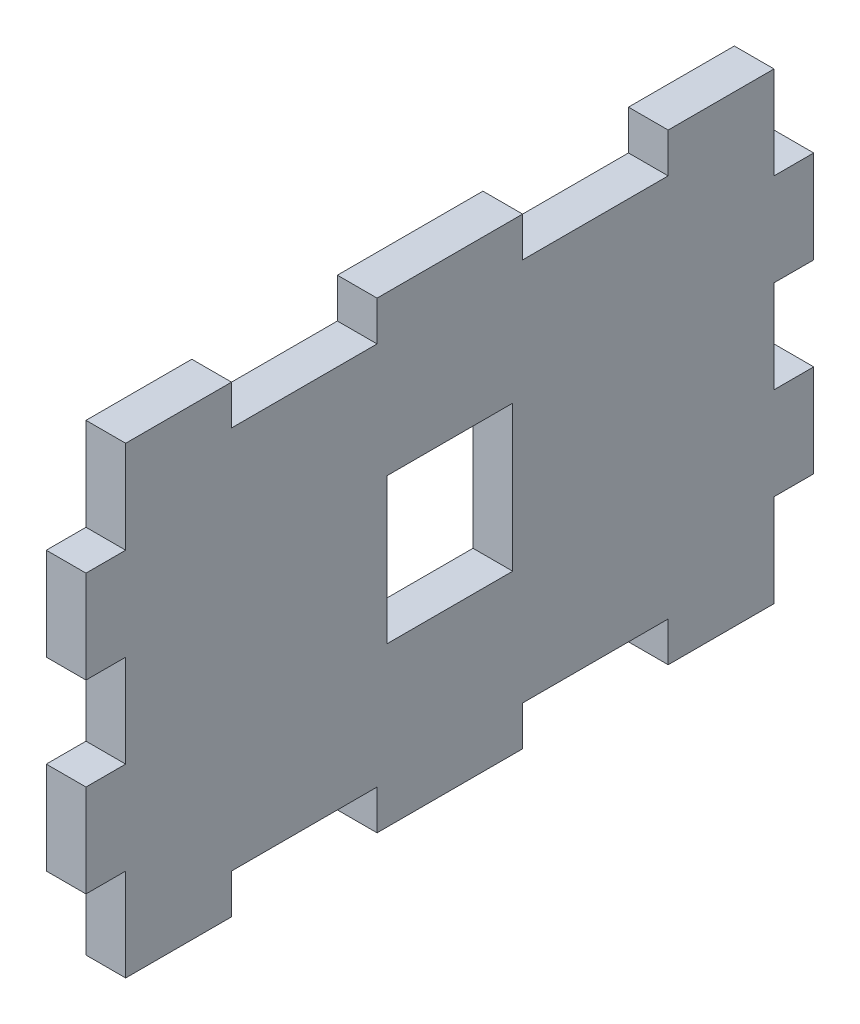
from build123d import *

# Parameters (mm, degrees)
SKETCH1_W           = 55
SKETCH1_H           = 35
BOSS_EXTRUDE1_DEPTH = 3
SKETCH3_W           = 11
SKETCH3_H           = 3
CUT_EXTRUDE1_DEPTH  = 3
SKETCH4_W           = 3
SKETCH4_H           = 7
CUT_EXTRUDE2_DEPTH  = 3
SKETCH5_W           = 9.5
SKETCH5_H           = 11
CUT_EXTRUDE3_DEPTH  = 10


with BuildPart() as part:
    # Sketch1 → Boss-Extrude1 (new body)
    with BuildSketch(Plane(origin=(0, 0, 0), x_dir=(0, 0, -1), z_dir=(1, 0, 0))):
        Rectangle(SKETCH1_W, SKETCH1_H)
    extrude(amount=BOSS_EXTRUDE1_DEPTH)

    # Sketch3 → Cut-Extrude1 (cut)
    with BuildSketch(Plane(origin=(3, 0, 0), x_dir=(0, 0, -1), z_dir=(1, 0, 0))):
        with Locations((-11, 16)):
            Rectangle(SKETCH3_W, SKETCH3_H)
        with Locations((11, 16)):
            Rectangle(SKETCH3_W, SKETCH3_H)
        with Locations((11, -16)):
            Rectangle(SKETCH3_W, SKETCH3_H)
        with Locations((-11, -16)):
            Rectangle(SKETCH3_W, SKETCH3_H)
    extrude(amount=-CUT_EXTRUDE1_DEPTH, mode=Mode.SUBTRACT)

    # Sketch4 → Cut-Extrude2 (cut)
    with BuildSketch(Plane(origin=(3, 0, 0), x_dir=(0, 0, -1), z_dir=(1, 0, 0))):
        with Locations((-26, 14)):
            Rectangle(SKETCH4_W, SKETCH4_H)
        with Locations((-26, 0)):
            Rectangle(SKETCH4_W, SKETCH4_H)
        with Locations((-26, -14)):
            Rectangle(SKETCH4_W, SKETCH4_H)
        with Locations((26, 14)):
            Rectangle(SKETCH4_W, SKETCH4_H)
        with Locations((26, 0)):
            Rectangle(SKETCH4_W, SKETCH4_H)
        with Locations((26, -14)):
            Rectangle(SKETCH4_W, SKETCH4_H)
    extrude(amount=-CUT_EXTRUDE2_DEPTH, mode=Mode.SUBTRACT)

    # Sketch5 → Cut-Extrude3 (cut)
    with BuildSketch(Plane(origin=(3, 0, 0), x_dir=(0, 0, -1), z_dir=(1, 0, 0))):
        Rectangle(SKETCH5_W, SKETCH5_H)
    extrude(amount=-CUT_EXTRUDE3_DEPTH, mode=Mode.SUBTRACT)


solid = part.part
